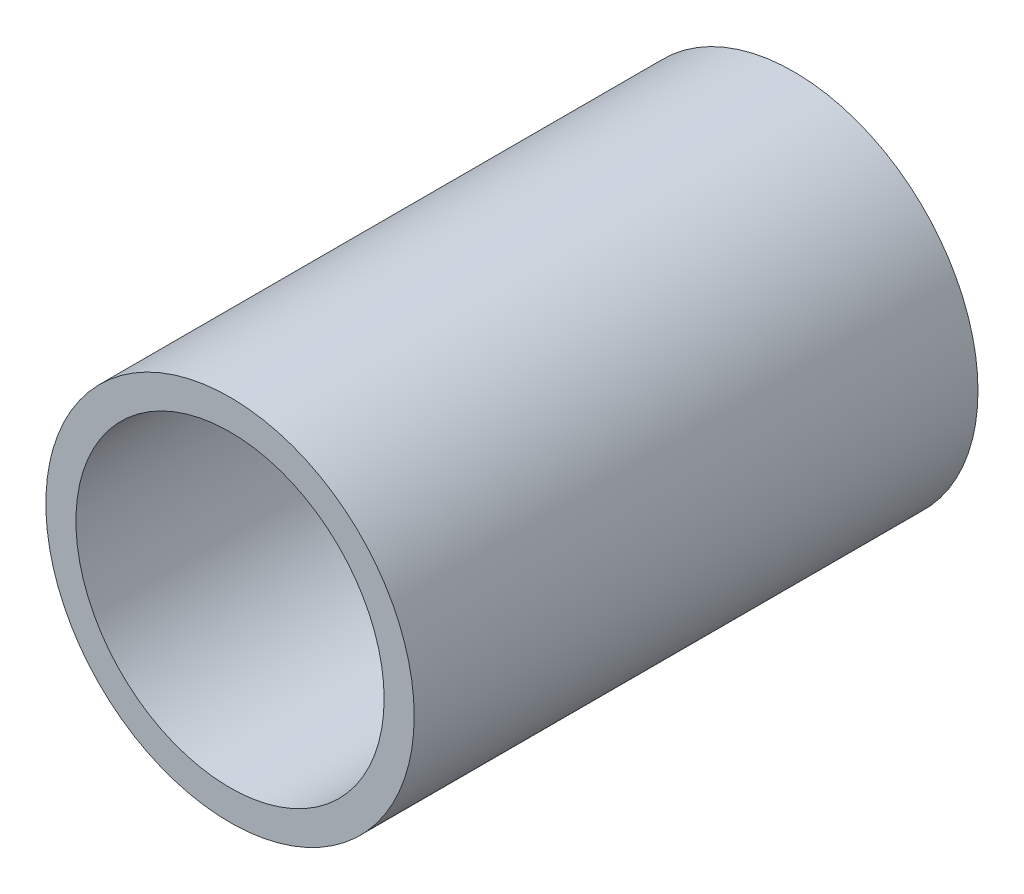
ISO-10303-21;
HEADER;
FILE_DESCRIPTION(('STEP AP214'),'2;1');
FILE_NAME('part.step','',(''),(''),'','','');
FILE_SCHEMA(('AUTOMOTIVE_DESIGN { 1 0 10303 214 1 1 1 1 }'));
ENDSEC;
DATA;
#1=APPLICATION_CONTEXT('core data for automotive mechanical design processes');
#2=APPLICATION_PROTOCOL_DEFINITION('international standard','automotive_design',2000,#1);
#3=PRODUCT_CONTEXT('',#1,'mechanical');
#4=PRODUCT('Part','Part','',(#3));
#5=PRODUCT_RELATED_PRODUCT_CATEGORY('part','',(#4));
#6=PRODUCT_DEFINITION_FORMATION('','',#4);
#7=PRODUCT_DEFINITION_CONTEXT('part definition',#1,'design');
#8=PRODUCT_DEFINITION('design','',#6,#7);
#9=PRODUCT_DEFINITION_SHAPE('','',#8);
#10=(LENGTH_UNIT() NAMED_UNIT(*) SI_UNIT(.MILLI.,.METRE.));
#11=(NAMED_UNIT(*) PLANE_ANGLE_UNIT() SI_UNIT($,.RADIAN.));
#12=(NAMED_UNIT(*) SI_UNIT($,.STERADIAN.) SOLID_ANGLE_UNIT());
#13=UNCERTAINTY_MEASURE_WITH_UNIT(LENGTH_MEASURE(1.E-05),#10,'distance_accuracy_value','');
#14=(GEOMETRIC_REPRESENTATION_CONTEXT(3) GLOBAL_UNCERTAINTY_ASSIGNED_CONTEXT((#13)) GLOBAL_UNIT_ASSIGNED_CONTEXT((#10,
#11,#12)) REPRESENTATION_CONTEXT('',''));
#15=CARTESIAN_POINT('',(0.,0.,0.));
#16=DIRECTION('',(0.,0.,1.));
#17=DIRECTION('',(1.,0.,0.));
#18=AXIS2_PLACEMENT_3D('',#15,#16,#17);
#19=CARTESIAN_POINT('',(0.,0.,15.));
#20=DIRECTION('',(0.,0.,1.));
#21=DIRECTION('',(1.,0.,0.));
#22=AXIS2_PLACEMENT_3D('',#19,#20,#21);
#23=PLANE('',#22);
#24=CARTESIAN_POINT('',(0.,0.,15.));
#25=DIRECTION('',(0.,0.,1.));
#26=DIRECTION('',(1.,0.,0.));
#27=AXIS2_PLACEMENT_3D('',#24,#25,#26);
#28=CIRCLE('',#27,4.9);
#29=CARTESIAN_POINT('',(4.9,0.,15.));
#30=VERTEX_POINT('',#29);
#31=EDGE_CURVE('E10',#30,#30,#28,.T.);
#32=ORIENTED_EDGE('',*,*,#31,.T.);
#33=EDGE_LOOP('',(#32));
#34=FACE_BOUND('',#33,.T.);
#35=CARTESIAN_POINT('',(0.,0.,15.));
#36=DIRECTION('',(0.,0.,1.));
#37=DIRECTION('',(1.,0.,0.));
#38=AXIS2_PLACEMENT_3D('',#35,#36,#37);
#39=CIRCLE('',#38,4.1);
#40=CARTESIAN_POINT('',(4.1,0.,15.));
#41=VERTEX_POINT('',#40);
#42=EDGE_CURVE('E37',#41,#41,#39,.T.);
#43=ORIENTED_EDGE('',*,*,#42,.F.);
#44=EDGE_LOOP('',(#43));
#45=FACE_BOUND('',#44,.T.);
#46=ADVANCED_FACE('F26',(#34,#45),#23,.T.);
#47=CARTESIAN_POINT('',(0.,0.,0.));
#48=DIRECTION('',(0.,0.,1.));
#49=DIRECTION('',(1.,0.,0.));
#50=AXIS2_PLACEMENT_3D('',#47,#48,#49);
#51=PLANE('',#50);
#52=CARTESIAN_POINT('',(0.,0.,0.));
#53=DIRECTION('',(0.,0.,1.));
#54=DIRECTION('',(1.,0.,0.));
#55=AXIS2_PLACEMENT_3D('',#52,#53,#54);
#56=CIRCLE('',#55,4.9);
#57=CARTESIAN_POINT('',(4.9,0.,0.));
#58=VERTEX_POINT('',#57);
#59=EDGE_CURVE('E33',#58,#58,#56,.T.);
#60=ORIENTED_EDGE('',*,*,#59,.F.);
#61=EDGE_LOOP('',(#60));
#62=FACE_BOUND('',#61,.T.);
#63=CARTESIAN_POINT('',(0.,0.,0.));
#64=DIRECTION('',(0.,0.,1.));
#65=DIRECTION('',(1.,0.,0.));
#66=AXIS2_PLACEMENT_3D('',#63,#64,#65);
#67=CIRCLE('',#66,4.1);
#68=CARTESIAN_POINT('',(4.1,0.,0.));
#69=VERTEX_POINT('',#68);
#70=EDGE_CURVE('E41',#69,#69,#67,.T.);
#71=ORIENTED_EDGE('',*,*,#70,.T.);
#72=EDGE_LOOP('',(#71));
#73=FACE_BOUND('',#72,.T.);
#74=ADVANCED_FACE('F47',(#62,#73),#51,.F.);
#75=CARTESIAN_POINT('',(0.,0.,15.));
#76=DIRECTION('',(0.,0.,-1.));
#77=DIRECTION('',(-1.,0.,0.));
#78=AXIS2_PLACEMENT_3D('',#75,#76,#77);
#79=CYLINDRICAL_SURFACE('',#78,4.9);
#80=ORIENTED_EDGE('',*,*,#31,.F.);
#81=EDGE_LOOP('',(#80));
#82=FACE_BOUND('',#81,.T.);
#83=ORIENTED_EDGE('',*,*,#59,.T.);
#84=EDGE_LOOP('',(#83));
#85=FACE_BOUND('',#84,.T.);
#86=ADVANCED_FACE('F28',(#82,#85),#79,.T.);
#87=CARTESIAN_POINT('',(0.,0.,15.));
#88=DIRECTION('',(0.,0.,-1.));
#89=DIRECTION('',(-1.,0.,0.));
#90=AXIS2_PLACEMENT_3D('',#87,#88,#89);
#91=CYLINDRICAL_SURFACE('',#90,4.1);
#92=ORIENTED_EDGE('',*,*,#42,.T.);
#93=EDGE_LOOP('',(#92));
#94=FACE_BOUND('',#93,.T.);
#95=ORIENTED_EDGE('',*,*,#70,.F.);
#96=EDGE_LOOP('',(#95));
#97=FACE_BOUND('',#96,.T.);
#98=ADVANCED_FACE('F49',(#94,#97),#91,.F.);
#99=CLOSED_SHELL('',(#46,#74,#86,#98));
#100=MANIFOLD_SOLID_BREP('B2',#99);
#101=ADVANCED_BREP_SHAPE_REPRESENTATION('',(#18,#100),#14);
#102=SHAPE_DEFINITION_REPRESENTATION(#9,#101);
ENDSEC;
END-ISO-10303-21;
